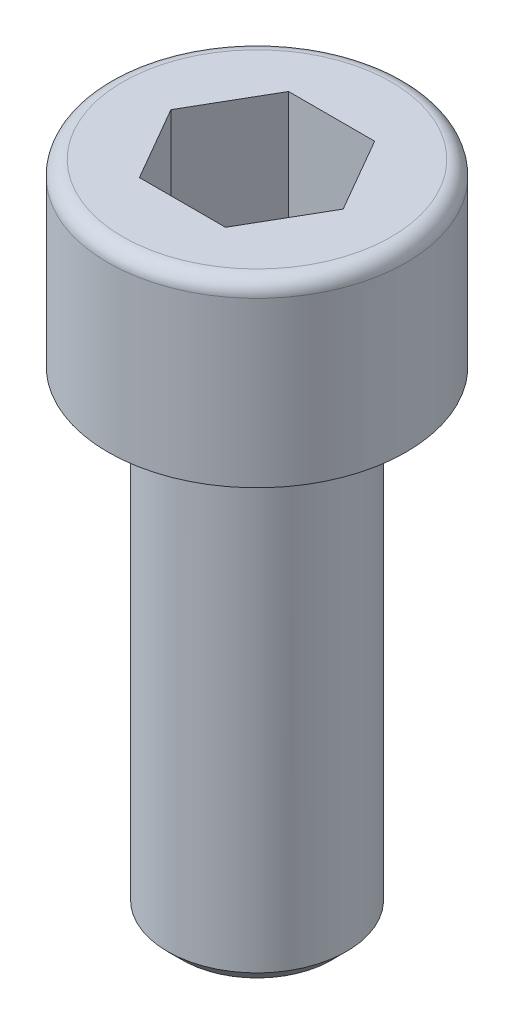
from build123d import *

# Parameters (mm, degrees)
ENL_V_MAT_EXTRU_1_DEPTH = 5
CHANFREIN1_SIZE         = 0.5


with BuildPart() as part:
    # Esquisse1 → Base-R_volution (revolve)
    with BuildSketch(Plane.XY, mode=Mode.PRIVATE) as base_r_volution_sk:
        with BuildLine():
            Line((0, 22), (-4.5, 22))
            ThreePointArc((-4.5, 22), (-4.853553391, 21.853553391), (-5, 21.5))
            Line((-5, 21.5), (-5, 16))
            Line((-5, 16), (-3, 16))
            Line((-3, 16), (-3, 0))
            Line((-3, 0), (0, 0))
            Line((0, 0), (0, 22))
        make_face()
    revolve(base_r_volution_sk.sketch.rotate(Axis((0, 50, 0), (0, -1, 0)), 270), axis=Axis((0, 50, 0), (0, -1, 0)))

    # Esquisse2 → Enl_v. mat.-Extru.1 (cut)
    with BuildSketch(Plane(origin=(0, 22, 0), x_dir=(-1, 0, 0), z_dir=(0, 1, 0))):
        Polygon((1.443375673, -2.5), (-1.443375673, -2.5), (-2.886751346, 0), (-1.443375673, 2.5), (1.443375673, 2.5), (2.886751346, 0), align=None)
    extrude(amount=-ENL_V_MAT_EXTRU_1_DEPTH, mode=Mode.SUBTRACT)

    # Chanfrein1
    chanfrein1_edges = [part.edges().sort_by_distance(p)[0] for p in [
        (0, 0, -3),
    ]]
    chamfer(chanfrein1_edges, length=CHANFREIN1_SIZE)


solid = part.part
